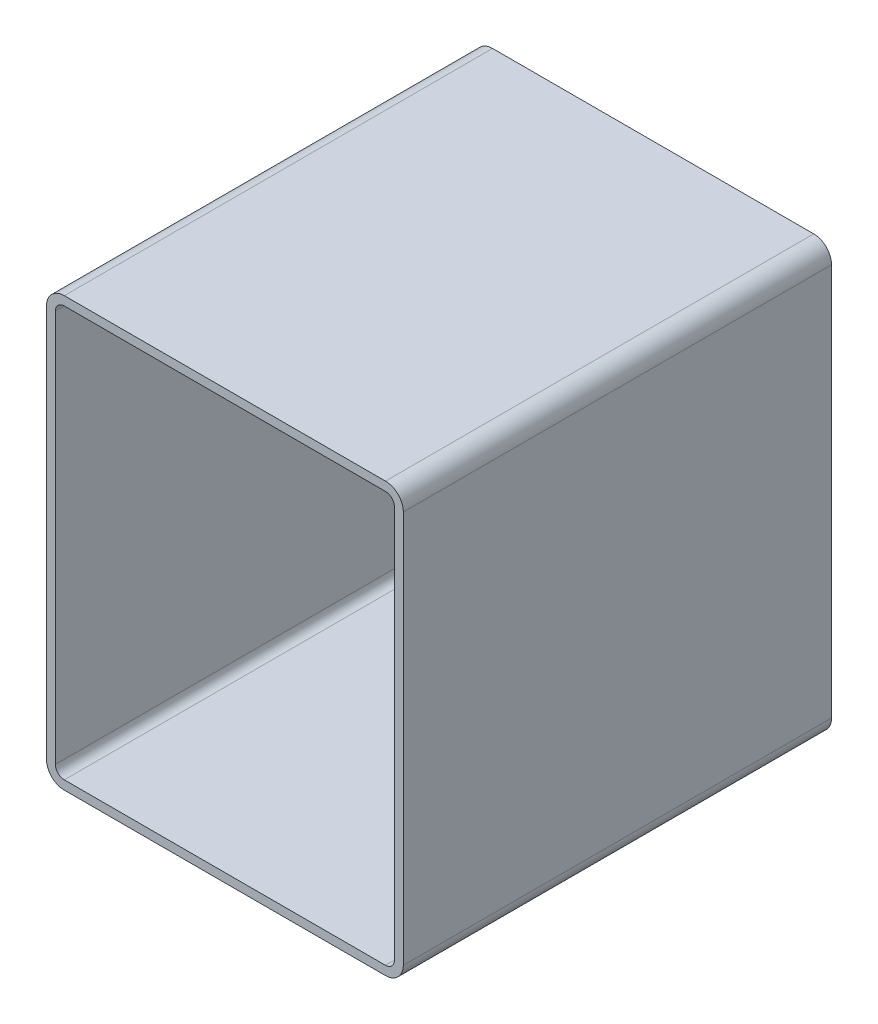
ISO-10303-21;
HEADER;
FILE_DESCRIPTION(('STEP AP214'),'2;1');
FILE_NAME('part.step','',(''),(''),'','','');
FILE_SCHEMA(('AUTOMOTIVE_DESIGN { 1 0 10303 214 1 1 1 1 }'));
ENDSEC;
DATA;
#1=APPLICATION_CONTEXT('core data for automotive mechanical design processes');
#2=APPLICATION_PROTOCOL_DEFINITION('international standard','automotive_design',2000,#1);
#3=PRODUCT_CONTEXT('',#1,'mechanical');
#4=PRODUCT('Part','Part','',(#3));
#5=PRODUCT_RELATED_PRODUCT_CATEGORY('part','',(#4));
#6=PRODUCT_DEFINITION_FORMATION('','',#4);
#7=PRODUCT_DEFINITION_CONTEXT('part definition',#1,'design');
#8=PRODUCT_DEFINITION('design','',#6,#7);
#9=PRODUCT_DEFINITION_SHAPE('','',#8);
#10=(LENGTH_UNIT() NAMED_UNIT(*) SI_UNIT(.MILLI.,.METRE.));
#11=(NAMED_UNIT(*) PLANE_ANGLE_UNIT() SI_UNIT($,.RADIAN.));
#12=(NAMED_UNIT(*) SI_UNIT($,.STERADIAN.) SOLID_ANGLE_UNIT());
#13=UNCERTAINTY_MEASURE_WITH_UNIT(LENGTH_MEASURE(1.E-05),#10,'distance_accuracy_value','');
#14=(GEOMETRIC_REPRESENTATION_CONTEXT(3) GLOBAL_UNCERTAINTY_ASSIGNED_CONTEXT((#13)) GLOBAL_UNIT_ASSIGNED_CONTEXT((#10,
#11,#12)) REPRESENTATION_CONTEXT('',''));
#15=CARTESIAN_POINT('',(0.,0.,0.));
#16=DIRECTION('',(0.,0.,1.));
#17=DIRECTION('',(1.,0.,0.));
#18=AXIS2_PLACEMENT_3D('',#15,#16,#17);
#19=CARTESIAN_POINT('',(15.4345794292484,293.974496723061,304.8));
#20=DIRECTION('',(0.,0.,1.));
#21=DIRECTION('',(1.,0.,0.));
#22=AXIS2_PLACEMENT_3D('',#19,#20,#21);
#23=PLANE('',#22);
#24=CARTESIAN_POINT('',(15.4345794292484,293.974496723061,304.8));
#25=DIRECTION('',(0.,0.,1.));
#26=DIRECTION('',(1.,0.,0.));
#27=AXIS2_PLACEMENT_3D('',#24,#25,#26);
#28=CIRCLE('',#27,12.7);
#29=CARTESIAN_POINT('',(15.4345794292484,306.674496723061,304.8));
#30=VERTEX_POINT('',#29);
#31=CARTESIAN_POINT('',(2.73457942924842,293.974496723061,304.8));
#32=VERTEX_POINT('',#31);
#33=EDGE_CURVE('E211',#30,#32,#28,.T.);
#34=ORIENTED_EDGE('',*,*,#33,.T.);
#35=DIRECTION('',(0.,-1.,0.));
#36=VECTOR('',#35,1.);
#37=CARTESIAN_POINT('',(2.73457942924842,14.5744967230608,304.8));
#38=LINE('',#37,#36);
#39=CARTESIAN_POINT('',(2.73457942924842,14.5744967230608,304.8));
#40=VERTEX_POINT('',#39);
#41=EDGE_CURVE('E214',#32,#40,#38,.T.);
#42=ORIENTED_EDGE('',*,*,#41,.T.);
#43=CARTESIAN_POINT('',(15.4345794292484,14.5744967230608,304.8));
#44=DIRECTION('',(0.,0.,1.));
#45=DIRECTION('',(1.,0.,0.));
#46=AXIS2_PLACEMENT_3D('',#43,#44,#45);
#47=CIRCLE('',#46,12.7);
#48=CARTESIAN_POINT('',(15.4345794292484,1.87449672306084,304.8));
#49=VERTEX_POINT('',#48);
#50=EDGE_CURVE('E217',#40,#49,#47,.T.);
#51=ORIENTED_EDGE('',*,*,#50,.T.);
#52=DIRECTION('',(1.,0.,0.));
#53=VECTOR('',#52,1.);
#54=CARTESIAN_POINT('',(244.034579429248,1.87449672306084,304.8));
#55=LINE('',#54,#53);
#56=CARTESIAN_POINT('',(244.034579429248,1.87449672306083,304.8));
#57=VERTEX_POINT('',#56);
#58=EDGE_CURVE('E219',#49,#57,#55,.T.);
#59=ORIENTED_EDGE('',*,*,#58,.T.);
#60=CARTESIAN_POINT('',(244.034579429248,14.5744967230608,304.8));
#61=DIRECTION('',(0.,0.,1.));
#62=DIRECTION('',(1.,0.,0.));
#63=AXIS2_PLACEMENT_3D('',#60,#61,#62);
#64=CIRCLE('',#63,12.7);
#65=CARTESIAN_POINT('',(256.734579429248,14.5744967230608,304.8));
#66=VERTEX_POINT('',#65);
#67=EDGE_CURVE('E221',#57,#66,#64,.T.);
#68=ORIENTED_EDGE('',*,*,#67,.T.);
#69=DIRECTION('',(0.,1.,0.));
#70=VECTOR('',#69,1.);
#71=CARTESIAN_POINT('',(256.734579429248,293.974496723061,304.8));
#72=LINE('',#71,#70);
#73=CARTESIAN_POINT('',(256.734579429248,293.974496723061,304.8));
#74=VERTEX_POINT('',#73);
#75=EDGE_CURVE('E223',#66,#74,#72,.T.);
#76=ORIENTED_EDGE('',*,*,#75,.T.);
#77=CARTESIAN_POINT('',(244.034579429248,293.974496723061,304.8));
#78=DIRECTION('',(0.,0.,1.));
#79=DIRECTION('',(1.,0.,0.));
#80=AXIS2_PLACEMENT_3D('',#77,#78,#79);
#81=CIRCLE('',#80,12.7);
#82=CARTESIAN_POINT('',(244.034579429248,306.674496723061,304.8));
#83=VERTEX_POINT('',#82);
#84=EDGE_CURVE('E225',#74,#83,#81,.T.);
#85=ORIENTED_EDGE('',*,*,#84,.T.);
#86=DIRECTION('',(-1.,0.,0.));
#87=VECTOR('',#86,1.);
#88=CARTESIAN_POINT('',(15.4345794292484,306.674496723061,304.8));
#89=LINE('',#88,#87);
#90=EDGE_CURVE('E227',#83,#30,#89,.T.);
#91=ORIENTED_EDGE('',*,*,#90,.T.);
#92=EDGE_LOOP('',(#34,#42,#51,#59,#68,#76,#85,#91));
#93=FACE_BOUND('',#92,.T.);
#94=DIRECTION('',(0.,-1.,0.));
#95=VECTOR('',#94,1.);
#96=CARTESIAN_POINT('',(9.08457942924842,14.5744967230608,304.8));
#97=LINE('',#96,#95);
#98=CARTESIAN_POINT('',(9.08457942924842,293.974496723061,304.8));
#99=VERTEX_POINT('',#98);
#100=CARTESIAN_POINT('',(9.08457942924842,14.5744967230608,304.8));
#101=VERTEX_POINT('',#100);
#102=EDGE_CURVE('E154',#99,#101,#97,.T.);
#103=ORIENTED_EDGE('',*,*,#102,.F.);
#104=CARTESIAN_POINT('',(15.4345794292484,293.974496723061,304.8));
#105=DIRECTION('',(0.,0.,1.));
#106=DIRECTION('',(1.,0.,0.));
#107=AXIS2_PLACEMENT_3D('',#104,#105,#106);
#108=CIRCLE('',#107,6.35000000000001);
#109=CARTESIAN_POINT('',(15.4345794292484,300.324496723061,304.8));
#110=VERTEX_POINT('',#109);
#111=EDGE_CURVE('E146',#110,#99,#108,.T.);
#112=ORIENTED_EDGE('',*,*,#111,.F.);
#113=DIRECTION('',(-1.,0.,0.));
#114=VECTOR('',#113,1.);
#115=CARTESIAN_POINT('',(15.4345794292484,300.324496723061,304.8));
#116=LINE('',#115,#114);
#117=CARTESIAN_POINT('',(244.034579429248,300.324496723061,304.8));
#118=VERTEX_POINT('',#117);
#119=EDGE_CURVE('E179',#118,#110,#116,.T.);
#120=ORIENTED_EDGE('',*,*,#119,.F.);
#121=CARTESIAN_POINT('',(244.034579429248,293.974496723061,304.8));
#122=DIRECTION('',(0.,0.,1.));
#123=DIRECTION('',(1.,0.,0.));
#124=AXIS2_PLACEMENT_3D('',#121,#122,#123);
#125=CIRCLE('',#124,6.35000000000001);
#126=CARTESIAN_POINT('',(250.384579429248,293.974496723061,304.8));
#127=VERTEX_POINT('',#126);
#128=EDGE_CURVE('E177',#127,#118,#125,.T.);
#129=ORIENTED_EDGE('',*,*,#128,.F.);
#130=DIRECTION('',(0.,1.,0.));
#131=VECTOR('',#130,1.);
#132=CARTESIAN_POINT('',(250.384579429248,293.974496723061,304.8));
#133=LINE('',#132,#131);
#134=CARTESIAN_POINT('',(250.384579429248,14.5744967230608,304.8));
#135=VERTEX_POINT('',#134);
#136=EDGE_CURVE('E175',#135,#127,#133,.T.);
#137=ORIENTED_EDGE('',*,*,#136,.F.);
#138=CARTESIAN_POINT('',(244.034579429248,14.5744967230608,304.8));
#139=DIRECTION('',(0.,0.,1.));
#140=DIRECTION('',(1.,0.,0.));
#141=AXIS2_PLACEMENT_3D('',#138,#139,#140);
#142=CIRCLE('',#141,6.35);
#143=CARTESIAN_POINT('',(244.034579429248,8.22449672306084,304.8));
#144=VERTEX_POINT('',#143);
#145=EDGE_CURVE('E173',#144,#135,#142,.T.);
#146=ORIENTED_EDGE('',*,*,#145,.F.);
#147=DIRECTION('',(1.,0.,0.));
#148=VECTOR('',#147,1.);
#149=CARTESIAN_POINT('',(244.034579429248,8.22449672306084,304.8));
#150=LINE('',#149,#148);
#151=CARTESIAN_POINT('',(15.4345794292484,8.22449672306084,304.8));
#152=VERTEX_POINT('',#151);
#153=EDGE_CURVE('E169',#152,#144,#150,.T.);
#154=ORIENTED_EDGE('',*,*,#153,.F.);
#155=CARTESIAN_POINT('',(15.4345794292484,14.5744967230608,304.8));
#156=DIRECTION('',(0.,0.,1.));
#157=DIRECTION('',(1.,0.,0.));
#158=AXIS2_PLACEMENT_3D('',#155,#156,#157);
#159=CIRCLE('',#158,6.35);
#160=EDGE_CURVE('E167',#101,#152,#159,.T.);
#161=ORIENTED_EDGE('',*,*,#160,.F.);
#162=EDGE_LOOP('',(#103,#112,#120,#129,#137,#146,#154,#161));
#163=FACE_BOUND('',#162,.T.);
#164=ADVANCED_FACE('F33',(#93,#163),#23,.T.);
#165=CARTESIAN_POINT('',(15.4345794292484,293.974496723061,0.));
#166=DIRECTION('',(0.,0.,1.));
#167=DIRECTION('',(1.,0.,0.));
#168=AXIS2_PLACEMENT_3D('',#165,#166,#167);
#169=PLANE('',#168);
#170=CARTESIAN_POINT('',(15.4345794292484,293.974496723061,0.));
#171=DIRECTION('',(0.,0.,1.));
#172=DIRECTION('',(1.,0.,0.));
#173=AXIS2_PLACEMENT_3D('',#170,#171,#172);
#174=CIRCLE('',#173,12.7);
#175=CARTESIAN_POINT('',(15.4345794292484,306.674496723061,0.));
#176=VERTEX_POINT('',#175);
#177=CARTESIAN_POINT('',(2.73457942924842,293.974496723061,0.));
#178=VERTEX_POINT('',#177);
#179=EDGE_CURVE('E162',#176,#178,#174,.T.);
#180=ORIENTED_EDGE('',*,*,#179,.F.);
#181=DIRECTION('',(-1.,0.,0.));
#182=VECTOR('',#181,1.);
#183=CARTESIAN_POINT('',(15.4345794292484,306.674496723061,0.));
#184=LINE('',#183,#182);
#185=CARTESIAN_POINT('',(244.034579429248,306.674496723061,0.));
#186=VERTEX_POINT('',#185);
#187=EDGE_CURVE('E215',#186,#176,#184,.T.);
#188=ORIENTED_EDGE('',*,*,#187,.F.);
#189=CARTESIAN_POINT('',(244.034579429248,293.974496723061,0.));
#190=DIRECTION('',(0.,0.,1.));
#191=DIRECTION('',(1.,0.,0.));
#192=AXIS2_PLACEMENT_3D('',#189,#190,#191);
#193=CIRCLE('',#192,12.7);
#194=CARTESIAN_POINT('',(256.734579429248,293.974496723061,0.));
#195=VERTEX_POINT('',#194);
#196=EDGE_CURVE('E242',#195,#186,#193,.T.);
#197=ORIENTED_EDGE('',*,*,#196,.F.);
#198=DIRECTION('',(0.,1.,0.));
#199=VECTOR('',#198,1.);
#200=CARTESIAN_POINT('',(256.734579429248,293.974496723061,0.));
#201=LINE('',#200,#199);
#202=CARTESIAN_POINT('',(256.734579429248,14.5744967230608,0.));
#203=VERTEX_POINT('',#202);
#204=EDGE_CURVE('E240',#203,#195,#201,.T.);
#205=ORIENTED_EDGE('',*,*,#204,.F.);
#206=CARTESIAN_POINT('',(244.034579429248,14.5744967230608,0.));
#207=DIRECTION('',(0.,0.,1.));
#208=DIRECTION('',(1.,0.,0.));
#209=AXIS2_PLACEMENT_3D('',#206,#207,#208);
#210=CIRCLE('',#209,12.7);
#211=CARTESIAN_POINT('',(244.034579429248,1.87449672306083,0.));
#212=VERTEX_POINT('',#211);
#213=EDGE_CURVE('E238',#212,#203,#210,.T.);
#214=ORIENTED_EDGE('',*,*,#213,.F.);
#215=DIRECTION('',(1.,0.,0.));
#216=VECTOR('',#215,1.);
#217=CARTESIAN_POINT('',(244.034579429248,1.87449672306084,0.));
#218=LINE('',#217,#216);
#219=CARTESIAN_POINT('',(15.4345794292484,1.87449672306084,0.));
#220=VERTEX_POINT('',#219);
#221=EDGE_CURVE('E236',#220,#212,#218,.T.);
#222=ORIENTED_EDGE('',*,*,#221,.F.);
#223=CARTESIAN_POINT('',(15.4345794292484,14.5744967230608,0.));
#224=DIRECTION('',(0.,0.,1.));
#225=DIRECTION('',(1.,0.,0.));
#226=AXIS2_PLACEMENT_3D('',#223,#224,#225);
#227=CIRCLE('',#226,12.7);
#228=CARTESIAN_POINT('',(2.73457942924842,14.5744967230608,0.));
#229=VERTEX_POINT('',#228);
#230=EDGE_CURVE('E234',#229,#220,#227,.T.);
#231=ORIENTED_EDGE('',*,*,#230,.F.);
#232=DIRECTION('',(0.,-1.,0.));
#233=VECTOR('',#232,1.);
#234=CARTESIAN_POINT('',(2.73457942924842,14.5744967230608,0.));
#235=LINE('',#234,#233);
#236=EDGE_CURVE('E232',#178,#229,#235,.T.);
#237=ORIENTED_EDGE('',*,*,#236,.F.);
#238=EDGE_LOOP('',(#180,#188,#197,#205,#214,#222,#231,#237));
#239=FACE_BOUND('',#238,.T.);
#240=CARTESIAN_POINT('',(15.4345794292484,293.974496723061,0.));
#241=DIRECTION('',(0.,0.,1.));
#242=DIRECTION('',(1.,0.,0.));
#243=AXIS2_PLACEMENT_3D('',#240,#241,#242);
#244=CIRCLE('',#243,6.35000000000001);
#245=CARTESIAN_POINT('',(15.4345794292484,300.324496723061,0.));
#246=VERTEX_POINT('',#245);
#247=CARTESIAN_POINT('',(9.08457942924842,293.974496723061,0.));
#248=VERTEX_POINT('',#247);
#249=EDGE_CURVE('E56',#246,#248,#244,.T.);
#250=ORIENTED_EDGE('',*,*,#249,.T.);
#251=DIRECTION('',(0.,-1.,0.));
#252=VECTOR('',#251,1.);
#253=CARTESIAN_POINT('',(9.08457942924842,14.5744967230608,0.));
#254=LINE('',#253,#252);
#255=CARTESIAN_POINT('',(9.08457942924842,14.5744967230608,0.));
#256=VERTEX_POINT('',#255);
#257=EDGE_CURVE('E161',#248,#256,#254,.T.);
#258=ORIENTED_EDGE('',*,*,#257,.T.);
#259=CARTESIAN_POINT('',(15.4345794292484,14.5744967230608,0.));
#260=DIRECTION('',(0.,0.,1.));
#261=DIRECTION('',(1.,0.,0.));
#262=AXIS2_PLACEMENT_3D('',#259,#260,#261);
#263=CIRCLE('',#262,6.35);
#264=CARTESIAN_POINT('',(15.4345794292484,8.22449672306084,0.));
#265=VERTEX_POINT('',#264);
#266=EDGE_CURVE('E183',#256,#265,#263,.T.);
#267=ORIENTED_EDGE('',*,*,#266,.T.);
#268=DIRECTION('',(1.,0.,0.));
#269=VECTOR('',#268,1.);
#270=CARTESIAN_POINT('',(244.034579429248,8.22449672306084,0.));
#271=LINE('',#270,#269);
#272=CARTESIAN_POINT('',(244.034579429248,8.22449672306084,0.));
#273=VERTEX_POINT('',#272);
#274=EDGE_CURVE('E186',#265,#273,#271,.T.);
#275=ORIENTED_EDGE('',*,*,#274,.T.);
#276=CARTESIAN_POINT('',(244.034579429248,14.5744967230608,0.));
#277=DIRECTION('',(0.,0.,1.));
#278=DIRECTION('',(1.,0.,0.));
#279=AXIS2_PLACEMENT_3D('',#276,#277,#278);
#280=CIRCLE('',#279,6.35);
#281=CARTESIAN_POINT('',(250.384579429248,14.5744967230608,0.));
#282=VERTEX_POINT('',#281);
#283=EDGE_CURVE('E189',#273,#282,#280,.T.);
#284=ORIENTED_EDGE('',*,*,#283,.T.);
#285=DIRECTION('',(0.,1.,0.));
#286=VECTOR('',#285,1.);
#287=CARTESIAN_POINT('',(250.384579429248,293.974496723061,0.));
#288=LINE('',#287,#286);
#289=CARTESIAN_POINT('',(250.384579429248,293.974496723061,0.));
#290=VERTEX_POINT('',#289);
#291=EDGE_CURVE('E192',#282,#290,#288,.T.);
#292=ORIENTED_EDGE('',*,*,#291,.T.);
#293=CARTESIAN_POINT('',(244.034579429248,293.974496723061,0.));
#294=DIRECTION('',(0.,0.,1.));
#295=DIRECTION('',(1.,0.,0.));
#296=AXIS2_PLACEMENT_3D('',#293,#294,#295);
#297=CIRCLE('',#296,6.35000000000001);
#298=CARTESIAN_POINT('',(244.034579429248,300.324496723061,0.));
#299=VERTEX_POINT('',#298);
#300=EDGE_CURVE('E195',#290,#299,#297,.T.);
#301=ORIENTED_EDGE('',*,*,#300,.T.);
#302=DIRECTION('',(-1.,0.,0.));
#303=VECTOR('',#302,1.);
#304=CARTESIAN_POINT('',(15.4345794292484,300.324496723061,0.));
#305=LINE('',#304,#303);
#306=EDGE_CURVE('E155',#299,#246,#305,.T.);
#307=ORIENTED_EDGE('',*,*,#306,.T.);
#308=EDGE_LOOP('',(#250,#258,#267,#275,#284,#292,#301,#307));
#309=FACE_BOUND('',#308,.T.);
#310=ADVANCED_FACE('F272',(#239,#309),#169,.F.);
#311=CARTESIAN_POINT('',(15.4345794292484,293.974496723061,304.8));
#312=DIRECTION('',(0.,0.,-1.));
#313=DIRECTION('',(-1.,0.,0.));
#314=AXIS2_PLACEMENT_3D('',#311,#312,#313);
#315=CYLINDRICAL_SURFACE('',#314,12.7);
#316=ORIENTED_EDGE('',*,*,#179,.T.);
#317=DIRECTION('',(0.,0.,-1.));
#318=VECTOR('',#317,1.);
#319=CARTESIAN_POINT('',(2.73457942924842,293.974496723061,304.8));
#320=LINE('',#319,#318);
#321=EDGE_CURVE('E11',#32,#178,#320,.T.);
#322=ORIENTED_EDGE('',*,*,#321,.F.);
#323=ORIENTED_EDGE('',*,*,#33,.F.);
#324=DIRECTION('',(0.,0.,-1.));
#325=VECTOR('',#324,1.);
#326=CARTESIAN_POINT('',(15.4345794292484,306.674496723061,304.8));
#327=LINE('',#326,#325);
#328=EDGE_CURVE('E229',#30,#176,#327,.T.);
#329=ORIENTED_EDGE('',*,*,#328,.T.);
#330=EDGE_LOOP('',(#316,#322,#323,#329));
#331=FACE_BOUND('',#330,.T.);
#332=ADVANCED_FACE('F35',(#331),#315,.T.);
#333=CARTESIAN_POINT('',(2.73457942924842,14.5744967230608,304.8));
#334=DIRECTION('',(1.,0.,0.));
#335=DIRECTION('',(0.,0.,-1.));
#336=AXIS2_PLACEMENT_3D('',#333,#334,#335);
#337=PLANE('',#336);
#338=ORIENTED_EDGE('',*,*,#236,.T.);
#339=DIRECTION('',(0.,0.,-1.));
#340=VECTOR('',#339,1.);
#341=CARTESIAN_POINT('',(2.73457942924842,14.5744967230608,304.8));
#342=LINE('',#341,#340);
#343=EDGE_CURVE('E41',#40,#229,#342,.T.);
#344=ORIENTED_EDGE('',*,*,#343,.F.);
#345=ORIENTED_EDGE('',*,*,#41,.F.);
#346=ORIENTED_EDGE('',*,*,#321,.T.);
#347=EDGE_LOOP('',(#338,#344,#345,#346));
#348=FACE_BOUND('',#347,.T.);
#349=ADVANCED_FACE('F289',(#348),#337,.F.);
#350=CARTESIAN_POINT('',(15.4345794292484,14.5744967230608,304.8));
#351=DIRECTION('',(0.,0.,-1.));
#352=DIRECTION('',(-1.,0.,0.));
#353=AXIS2_PLACEMENT_3D('',#350,#351,#352);
#354=CYLINDRICAL_SURFACE('',#353,12.7);
#355=ORIENTED_EDGE('',*,*,#230,.T.);
#356=DIRECTION('',(0.,0.,-1.));
#357=VECTOR('',#356,1.);
#358=CARTESIAN_POINT('',(15.4345794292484,1.87449672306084,304.8));
#359=LINE('',#358,#357);
#360=EDGE_CURVE('E259',#49,#220,#359,.T.);
#361=ORIENTED_EDGE('',*,*,#360,.F.);
#362=ORIENTED_EDGE('',*,*,#50,.F.);
#363=ORIENTED_EDGE('',*,*,#343,.T.);
#364=EDGE_LOOP('',(#355,#361,#362,#363));
#365=FACE_BOUND('',#364,.T.);
#366=ADVANCED_FACE('F266',(#365),#354,.T.);
#367=CARTESIAN_POINT('',(244.034579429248,1.87449672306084,304.8));
#368=DIRECTION('',(0.,1.,0.));
#369=DIRECTION('',(0.,0.,1.));
#370=AXIS2_PLACEMENT_3D('',#367,#368,#369);
#371=PLANE('',#370);
#372=ORIENTED_EDGE('',*,*,#221,.T.);
#373=DIRECTION('',(0.,0.,-1.));
#374=VECTOR('',#373,1.);
#375=CARTESIAN_POINT('',(244.034579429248,1.87449672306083,304.8));
#376=LINE('',#375,#374);
#377=EDGE_CURVE('E256',#57,#212,#376,.T.);
#378=ORIENTED_EDGE('',*,*,#377,.F.);
#379=ORIENTED_EDGE('',*,*,#58,.F.);
#380=ORIENTED_EDGE('',*,*,#360,.T.);
#381=EDGE_LOOP('',(#372,#378,#379,#380));
#382=FACE_BOUND('',#381,.T.);
#383=ADVANCED_FACE('F278',(#382),#371,.F.);
#384=CARTESIAN_POINT('',(244.034579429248,14.5744967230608,304.8));
#385=DIRECTION('',(0.,0.,-1.));
#386=DIRECTION('',(-1.,0.,0.));
#387=AXIS2_PLACEMENT_3D('',#384,#385,#386);
#388=CYLINDRICAL_SURFACE('',#387,12.7);
#389=ORIENTED_EDGE('',*,*,#213,.T.);
#390=DIRECTION('',(0.,0.,-1.));
#391=VECTOR('',#390,1.);
#392=CARTESIAN_POINT('',(256.734579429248,14.5744967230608,304.8));
#393=LINE('',#392,#391);
#394=EDGE_CURVE('E253',#66,#203,#393,.T.);
#395=ORIENTED_EDGE('',*,*,#394,.F.);
#396=ORIENTED_EDGE('',*,*,#67,.F.);
#397=ORIENTED_EDGE('',*,*,#377,.T.);
#398=EDGE_LOOP('',(#389,#395,#396,#397));
#399=FACE_BOUND('',#398,.T.);
#400=ADVANCED_FACE('F282',(#399),#388,.T.);
#401=CARTESIAN_POINT('',(256.734579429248,293.974496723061,304.8));
#402=DIRECTION('',(-1.,0.,0.));
#403=DIRECTION('',(0.,0.,1.));
#404=AXIS2_PLACEMENT_3D('',#401,#402,#403);
#405=PLANE('',#404);
#406=ORIENTED_EDGE('',*,*,#204,.T.);
#407=DIRECTION('',(0.,0.,-1.));
#408=VECTOR('',#407,1.);
#409=CARTESIAN_POINT('',(256.734579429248,293.974496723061,304.8));
#410=LINE('',#409,#408);
#411=EDGE_CURVE('E250',#74,#195,#410,.T.);
#412=ORIENTED_EDGE('',*,*,#411,.F.);
#413=ORIENTED_EDGE('',*,*,#75,.F.);
#414=ORIENTED_EDGE('',*,*,#394,.T.);
#415=EDGE_LOOP('',(#406,#412,#413,#414));
#416=FACE_BOUND('',#415,.T.);
#417=ADVANCED_FACE('F302',(#416),#405,.F.);
#418=CARTESIAN_POINT('',(244.034579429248,293.974496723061,304.8));
#419=DIRECTION('',(0.,0.,-1.));
#420=DIRECTION('',(-1.,0.,0.));
#421=AXIS2_PLACEMENT_3D('',#418,#419,#420);
#422=CYLINDRICAL_SURFACE('',#421,12.7);
#423=ORIENTED_EDGE('',*,*,#196,.T.);
#424=DIRECTION('',(0.,0.,-1.));
#425=VECTOR('',#424,1.);
#426=CARTESIAN_POINT('',(244.034579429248,306.674496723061,304.8));
#427=LINE('',#426,#425);
#428=EDGE_CURVE('E247',#83,#186,#427,.T.);
#429=ORIENTED_EDGE('',*,*,#428,.F.);
#430=ORIENTED_EDGE('',*,*,#84,.F.);
#431=ORIENTED_EDGE('',*,*,#411,.T.);
#432=EDGE_LOOP('',(#423,#429,#430,#431));
#433=FACE_BOUND('',#432,.T.);
#434=ADVANCED_FACE('F300',(#433),#422,.T.);
#435=CARTESIAN_POINT('',(15.4345794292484,306.674496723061,304.8));
#436=DIRECTION('',(0.,-1.,0.));
#437=DIRECTION('',(0.,0.,-1.));
#438=AXIS2_PLACEMENT_3D('',#435,#436,#437);
#439=PLANE('',#438);
#440=ORIENTED_EDGE('',*,*,#187,.T.);
#441=ORIENTED_EDGE('',*,*,#328,.F.);
#442=ORIENTED_EDGE('',*,*,#90,.F.);
#443=ORIENTED_EDGE('',*,*,#428,.T.);
#444=EDGE_LOOP('',(#440,#441,#442,#443));
#445=FACE_BOUND('',#444,.T.);
#446=ADVANCED_FACE('F295',(#445),#439,.F.);
#447=CARTESIAN_POINT('',(15.4345794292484,293.974496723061,304.8));
#448=DIRECTION('',(0.,0.,-1.));
#449=DIRECTION('',(-1.,0.,0.));
#450=AXIS2_PLACEMENT_3D('',#447,#448,#449);
#451=CYLINDRICAL_SURFACE('',#450,6.35000000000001);
#452=ORIENTED_EDGE('',*,*,#249,.F.);
#453=DIRECTION('',(0.,0.,-1.));
#454=VECTOR('',#453,1.);
#455=CARTESIAN_POINT('',(15.4345794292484,300.324496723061,304.8));
#456=LINE('',#455,#454);
#457=EDGE_CURVE('E150',#110,#246,#456,.T.);
#458=ORIENTED_EDGE('',*,*,#457,.F.);
#459=ORIENTED_EDGE('',*,*,#111,.T.);
#460=DIRECTION('',(0.,0.,-1.));
#461=VECTOR('',#460,1.);
#462=CARTESIAN_POINT('',(9.08457942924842,293.974496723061,304.8));
#463=LINE('',#462,#461);
#464=EDGE_CURVE('E149',#99,#248,#463,.T.);
#465=ORIENTED_EDGE('',*,*,#464,.T.);
#466=EDGE_LOOP('',(#452,#458,#459,#465));
#467=FACE_BOUND('',#466,.T.);
#468=ADVANCED_FACE('F148',(#467),#451,.F.);
#469=CARTESIAN_POINT('',(9.08457942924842,14.5744967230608,304.8));
#470=DIRECTION('',(1.,0.,0.));
#471=DIRECTION('',(0.,0.,-1.));
#472=AXIS2_PLACEMENT_3D('',#469,#470,#471);
#473=PLANE('',#472);
#474=ORIENTED_EDGE('',*,*,#257,.F.);
#475=ORIENTED_EDGE('',*,*,#464,.F.);
#476=ORIENTED_EDGE('',*,*,#102,.T.);
#477=DIRECTION('',(0.,0.,-1.));
#478=VECTOR('',#477,1.);
#479=CARTESIAN_POINT('',(9.08457942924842,14.5744967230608,304.8));
#480=LINE('',#479,#478);
#481=EDGE_CURVE('E163',#101,#256,#480,.T.);
#482=ORIENTED_EDGE('',*,*,#481,.T.);
#483=EDGE_LOOP('',(#474,#475,#476,#482));
#484=FACE_BOUND('',#483,.T.);
#485=ADVANCED_FACE('F158',(#484),#473,.T.);
#486=CARTESIAN_POINT('',(15.4345794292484,14.5744967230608,304.8));
#487=DIRECTION('',(0.,0.,-1.));
#488=DIRECTION('',(-1.,0.,0.));
#489=AXIS2_PLACEMENT_3D('',#486,#487,#488);
#490=CYLINDRICAL_SURFACE('',#489,6.35);
#491=ORIENTED_EDGE('',*,*,#266,.F.);
#492=ORIENTED_EDGE('',*,*,#481,.F.);
#493=ORIENTED_EDGE('',*,*,#160,.T.);
#494=DIRECTION('',(0.,0.,-1.));
#495=VECTOR('',#494,1.);
#496=CARTESIAN_POINT('',(15.4345794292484,8.22449672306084,304.8));
#497=LINE('',#496,#495);
#498=EDGE_CURVE('E208',#152,#265,#497,.T.);
#499=ORIENTED_EDGE('',*,*,#498,.T.);
#500=EDGE_LOOP('',(#491,#492,#493,#499));
#501=FACE_BOUND('',#500,.T.);
#502=ADVANCED_FACE('F327',(#501),#490,.F.);
#503=CARTESIAN_POINT('',(244.034579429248,8.22449672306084,304.8));
#504=DIRECTION('',(0.,1.,0.));
#505=DIRECTION('',(0.,0.,1.));
#506=AXIS2_PLACEMENT_3D('',#503,#504,#505);
#507=PLANE('',#506);
#508=ORIENTED_EDGE('',*,*,#274,.F.);
#509=ORIENTED_EDGE('',*,*,#498,.F.);
#510=ORIENTED_EDGE('',*,*,#153,.T.);
#511=DIRECTION('',(0.,0.,-1.));
#512=VECTOR('',#511,1.);
#513=CARTESIAN_POINT('',(244.034579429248,8.22449672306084,304.8));
#514=LINE('',#513,#512);
#515=EDGE_CURVE('E206',#144,#273,#514,.T.);
#516=ORIENTED_EDGE('',*,*,#515,.T.);
#517=EDGE_LOOP('',(#508,#509,#510,#516));
#518=FACE_BOUND('',#517,.T.);
#519=ADVANCED_FACE('F331',(#518),#507,.T.);
#520=CARTESIAN_POINT('',(244.034579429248,14.5744967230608,304.8));
#521=DIRECTION('',(0.,0.,-1.));
#522=DIRECTION('',(-1.,0.,0.));
#523=AXIS2_PLACEMENT_3D('',#520,#521,#522);
#524=CYLINDRICAL_SURFACE('',#523,6.35);
#525=ORIENTED_EDGE('',*,*,#283,.F.);
#526=ORIENTED_EDGE('',*,*,#515,.F.);
#527=ORIENTED_EDGE('',*,*,#145,.T.);
#528=DIRECTION('',(0.,0.,-1.));
#529=VECTOR('',#528,1.);
#530=CARTESIAN_POINT('',(250.384579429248,14.5744967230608,304.8));
#531=LINE('',#530,#529);
#532=EDGE_CURVE('E204',#135,#282,#531,.T.);
#533=ORIENTED_EDGE('',*,*,#532,.T.);
#534=EDGE_LOOP('',(#525,#526,#527,#533));
#535=FACE_BOUND('',#534,.T.);
#536=ADVANCED_FACE('F337',(#535),#524,.F.);
#537=CARTESIAN_POINT('',(250.384579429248,293.974496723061,304.8));
#538=DIRECTION('',(-1.,0.,0.));
#539=DIRECTION('',(0.,0.,1.));
#540=AXIS2_PLACEMENT_3D('',#537,#538,#539);
#541=PLANE('',#540);
#542=ORIENTED_EDGE('',*,*,#291,.F.);
#543=ORIENTED_EDGE('',*,*,#532,.F.);
#544=ORIENTED_EDGE('',*,*,#136,.T.);
#545=DIRECTION('',(0.,0.,-1.));
#546=VECTOR('',#545,1.);
#547=CARTESIAN_POINT('',(250.384579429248,293.974496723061,304.8));
#548=LINE('',#547,#546);
#549=EDGE_CURVE('E202',#127,#290,#548,.T.);
#550=ORIENTED_EDGE('',*,*,#549,.T.);
#551=EDGE_LOOP('',(#542,#543,#544,#550));
#552=FACE_BOUND('',#551,.T.);
#553=ADVANCED_FACE('F341',(#552),#541,.T.);
#554=CARTESIAN_POINT('',(244.034579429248,293.974496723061,304.8));
#555=DIRECTION('',(0.,0.,-1.));
#556=DIRECTION('',(-1.,0.,0.));
#557=AXIS2_PLACEMENT_3D('',#554,#555,#556);
#558=CYLINDRICAL_SURFACE('',#557,6.35000000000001);
#559=ORIENTED_EDGE('',*,*,#300,.F.);
#560=ORIENTED_EDGE('',*,*,#549,.F.);
#561=ORIENTED_EDGE('',*,*,#128,.T.);
#562=DIRECTION('',(0.,0.,-1.));
#563=VECTOR('',#562,1.);
#564=CARTESIAN_POINT('',(244.034579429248,300.324496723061,304.8));
#565=LINE('',#564,#563);
#566=EDGE_CURVE('E48',#118,#299,#565,.T.);
#567=ORIENTED_EDGE('',*,*,#566,.T.);
#568=EDGE_LOOP('',(#559,#560,#561,#567));
#569=FACE_BOUND('',#568,.T.);
#570=ADVANCED_FACE('F345',(#569),#558,.F.);
#571=CARTESIAN_POINT('',(15.4345794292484,300.324496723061,304.8));
#572=DIRECTION('',(0.,-1.,0.));
#573=DIRECTION('',(0.,0.,-1.));
#574=AXIS2_PLACEMENT_3D('',#571,#572,#573);
#575=PLANE('',#574);
#576=ORIENTED_EDGE('',*,*,#306,.F.);
#577=ORIENTED_EDGE('',*,*,#566,.F.);
#578=ORIENTED_EDGE('',*,*,#119,.T.);
#579=ORIENTED_EDGE('',*,*,#457,.T.);
#580=EDGE_LOOP('',(#576,#577,#578,#579));
#581=FACE_BOUND('',#580,.T.);
#582=ADVANCED_FACE('F349',(#581),#575,.T.);
#583=CLOSED_SHELL('',(#164,#310,#332,#349,#366,#383,#400,#417,#434,#446,#468,#485,#502,#519,
#536,#553,#570,#582));
#584=MANIFOLD_SOLID_BREP('B2',#583);
#585=ADVANCED_BREP_SHAPE_REPRESENTATION('',(#18,#584),#14);
#586=SHAPE_DEFINITION_REPRESENTATION(#9,#585);
ENDSEC;
END-ISO-10303-21;
